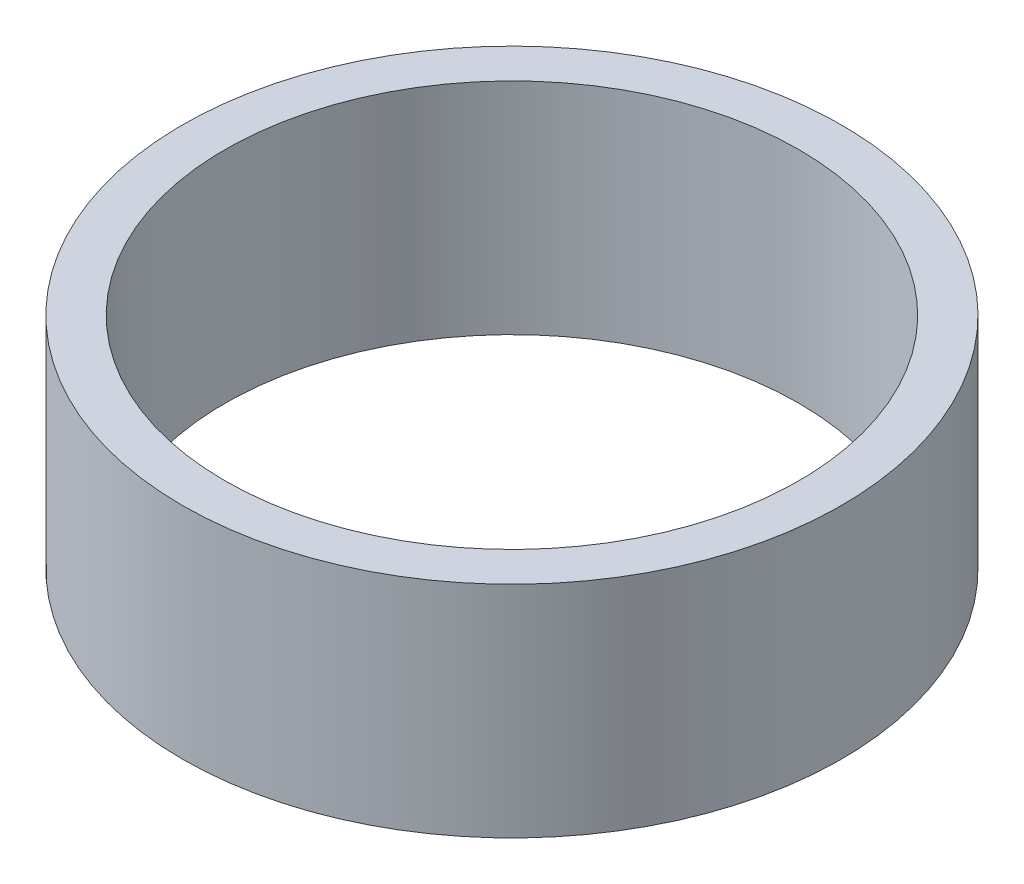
from build123d import *

# Parameters (mm, degrees)
SKETCH_2_W = 1.65
SKETCH_2_H = 8.5


with BuildPart() as part:
    # Sketch 2 → Revolve 1 (revolve)
    with BuildSketch(Plane(origin=(0, 0, 0), x_dir=(0, 0, -1), z_dir=(1, 0, 0)), mode=Mode.PRIVATE) as revolve_1_sk:
        with Locations((11.925, -4.25)):
            Rectangle(SKETCH_2_W, SKETCH_2_H)
    revolve(revolve_1_sk.sketch.rotate(Axis((0, 4.755058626, 0), (0, -1, 0)), 180), axis=Axis((0, 4.755058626, 0), (0, -1, 0)))


solid = part.part
